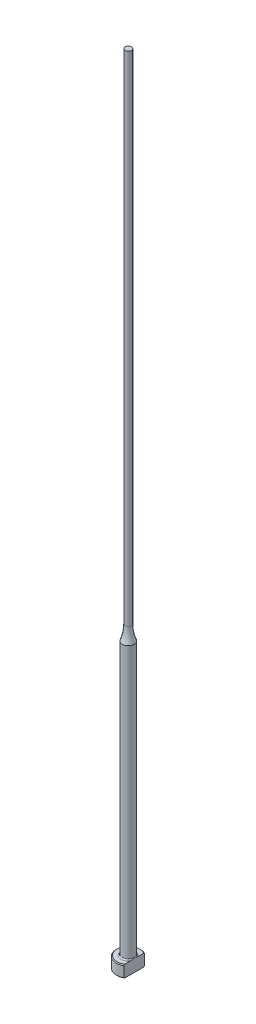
from build123d import *
from build123d.topology import SkipClean

# Parameters (mm, degrees)
CHAMFER1_SIZE = 0.2
FILLET1_R     = 0.3
KEY_DEPTH     = 201.044994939


with BuildPart() as part:
    # Sketch1 → Revolve1 (revolve)
    with BuildSketch(Plane.XY, mode=Mode.PRIVATE) as revolve1_sk:
        with BuildLine():
            Line((0, 0), (-3, 0))
            Line((-3, 0), (-3, 3))
            Line((-3, 3), (-1.5, 3))
            Line((-1.5, 3), (-1.5, 71.32440481))
            ThreePointArc((-1.5, 71.32440481), (-0.976558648, 73.129171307), (-0.8, 75))
            Line((-0.8, 75), (-0.8, 200))
            Line((-0.8, 200), (0, 200))
            Line((0, 200), (0, 0))
        make_face()
    revolve(revolve1_sk.sketch.rotate(Axis((0, 259.958771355, 0), (0, -1, 0)), 270), axis=Axis((0, 259.958771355, 0), (0, -1, 0)))

    # Chamfer1
    chamfer1_edges = [part.edges().sort_by_distance(p)[0] for p in [
        (0, 0, -3),
        (0, 3, -3),
    ]]
    chamfer(chamfer1_edges, length=CHAMFER1_SIZE)

    # Fillet1
    fillet1_edges = [part.edges().sort_by_distance(p)[0] for p in [
        (0, 3, -1.5),
    ]]
    fillet(fillet1_edges, radius=FILLET1_R)

    # Sketch2 → KEY (cut, through all)
    with SkipClean():  # the faces are left unmerged after this step: merging them gives an invalid solid
        with BuildSketch(Plane(origin=(0, 0, 0), x_dir=(1, 0, 0), z_dir=(0, 1, 0))):
            with BuildLine():
                Line((1.5, 2.598076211), (1.5, -2.598076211))
                ThreePointArc((1.5, -2.598076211), (3, 0), (1.5, 2.598076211))
            make_face()
        extrude(amount=KEY_DEPTH, mode=Mode.SUBTRACT)


solid = part.part
